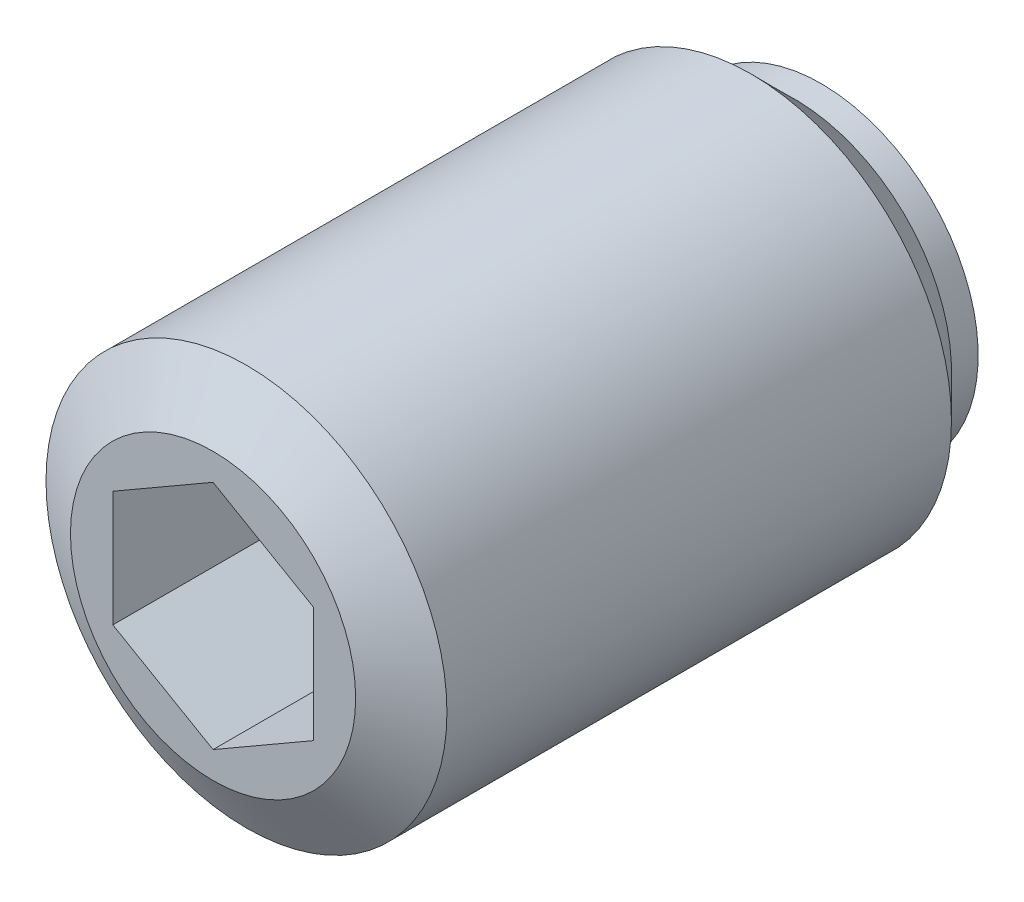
ISO-10303-21;
HEADER;
FILE_DESCRIPTION(('STEP AP214'),'2;1');
FILE_NAME('part.step','',(''),(''),'','','');
FILE_SCHEMA(('AUTOMOTIVE_DESIGN { 1 0 10303 214 1 1 1 1 }'));
ENDSEC;
DATA;
#1=APPLICATION_CONTEXT('core data for automotive mechanical design processes');
#2=APPLICATION_PROTOCOL_DEFINITION('international standard','automotive_design',2000,#1);
#3=PRODUCT_CONTEXT('',#1,'mechanical');
#4=PRODUCT('Part','Part','',(#3));
#5=PRODUCT_RELATED_PRODUCT_CATEGORY('part','',(#4));
#6=PRODUCT_DEFINITION_FORMATION('','',#4);
#7=PRODUCT_DEFINITION_CONTEXT('part definition',#1,'design');
#8=PRODUCT_DEFINITION('design','',#6,#7);
#9=PRODUCT_DEFINITION_SHAPE('','',#8);
#10=(LENGTH_UNIT() NAMED_UNIT(*) SI_UNIT(.MILLI.,.METRE.));
#11=(NAMED_UNIT(*) PLANE_ANGLE_UNIT() SI_UNIT($,.RADIAN.));
#12=(NAMED_UNIT(*) SI_UNIT($,.STERADIAN.) SOLID_ANGLE_UNIT());
#13=UNCERTAINTY_MEASURE_WITH_UNIT(LENGTH_MEASURE(1.E-05),#10,'distance_accuracy_value','');
#14=(GEOMETRIC_REPRESENTATION_CONTEXT(3) GLOBAL_UNCERTAINTY_ASSIGNED_CONTEXT((#13)) GLOBAL_UNIT_ASSIGNED_CONTEXT((#10,
#11,#12)) REPRESENTATION_CONTEXT('',''));
#15=CARTESIAN_POINT('',(0.,0.,0.));
#16=DIRECTION('',(0.,0.,1.));
#17=DIRECTION('',(1.,0.,0.));
#18=AXIS2_PLACEMENT_3D('',#15,#16,#17);
#19=CARTESIAN_POINT('',(0.,0.,2.));
#20=DIRECTION('',(0.,0.,1.));
#21=DIRECTION('',(0.,-1.,0.));
#22=AXIS2_PLACEMENT_3D('',#19,#20,#21);
#23=SPHERICAL_SURFACE('',#22,2.);
#24=CARTESIAN_POINT('',(0.,0.,0.9));
#25=DIRECTION('',(0.,0.,1.));
#26=DIRECTION('',(-1.,0.,0.));
#27=AXIS2_PLACEMENT_3D('',#24,#25,#26);
#28=CIRCLE('',#27,1.67032930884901);
#29=CARTESIAN_POINT('',(-1.67032930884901,0.,0.9));
#30=VERTEX_POINT('',#29);
#31=EDGE_CURVE('E9',#30,#30,#28,.T.);
#32=ORIENTED_EDGE('',*,*,#31,.F.);
#33=EDGE_LOOP('',(#32));
#34=FACE_BOUND('',#33,.T.);
#35=ADVANCED_FACE('F14',(#34),#23,.T.);
#36=CARTESIAN_POINT('',(0.,2.35,0.9));
#37=DIRECTION('',(0.,0.,1.));
#38=DIRECTION('',(-1.,0.,0.));
#39=AXIS2_PLACEMENT_3D('',#36,#37,#38);
#40=PLANE('',#39);
#41=CARTESIAN_POINT('',(0.,0.,0.9));
#42=DIRECTION('',(0.,0.,1.));
#43=DIRECTION('',(-1.,0.,0.));
#44=AXIS2_PLACEMENT_3D('',#41,#42,#43);
#45=CIRCLE('',#44,2.35);
#46=CARTESIAN_POINT('',(-2.35,0.,0.9));
#47=VERTEX_POINT('',#46);
#48=EDGE_CURVE('E21',#47,#47,#45,.T.);
#49=ORIENTED_EDGE('',*,*,#48,.F.);
#50=EDGE_LOOP('',(#49));
#51=FACE_BOUND('',#50,.T.);
#52=ORIENTED_EDGE('',*,*,#31,.T.);
#53=EDGE_LOOP('',(#52));
#54=FACE_BOUND('',#53,.T.);
#55=ADVANCED_FACE('F138',(#51,#54),#40,.F.);
#56=CARTESIAN_POINT('',(0.,0.,11.3950749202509));
#57=DIRECTION('',(0.,0.,1.));
#58=DIRECTION('',(-1.,0.,0.));
#59=AXIS2_PLACEMENT_3D('',#56,#57,#58);
#60=CYLINDRICAL_SURFACE('',#59,2.35);
#61=CARTESIAN_POINT('',(0.,0.,1.3));
#62=DIRECTION('',(0.,0.,1.));
#63=DIRECTION('',(-1.,0.,0.));
#64=AXIS2_PLACEMENT_3D('',#61,#62,#63);
#65=CIRCLE('',#64,2.35);
#66=CARTESIAN_POINT('',(-2.35,0.,1.3));
#67=VERTEX_POINT('',#66);
#68=EDGE_CURVE('E131',#67,#67,#65,.T.);
#69=ORIENTED_EDGE('',*,*,#68,.F.);
#70=EDGE_LOOP('',(#69));
#71=FACE_BOUND('',#70,.T.);
#72=ORIENTED_EDGE('',*,*,#48,.T.);
#73=EDGE_LOOP('',(#72));
#74=FACE_BOUND('',#73,.T.);
#75=ADVANCED_FACE('F136',(#71,#74),#60,.T.);
#76=CARTESIAN_POINT('',(0.,0.,1.3));
#77=DIRECTION('',(0.,0.,1.));
#78=DIRECTION('',(-1.,0.,0.));
#79=AXIS2_PLACEMENT_3D('',#76,#77,#78);
#80=CONICAL_SURFACE('',#79,2.35,0.78539816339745);
#81=CARTESIAN_POINT('',(0.,0.,1.95));
#82=DIRECTION('',(0.,0.,1.));
#83=DIRECTION('',(-1.,0.,0.));
#84=AXIS2_PLACEMENT_3D('',#81,#82,#83);
#85=CIRCLE('',#84,3.);
#86=CARTESIAN_POINT('',(-3.,0.,1.95));
#87=VERTEX_POINT('',#86);
#88=EDGE_CURVE('E128',#87,#87,#85,.T.);
#89=ORIENTED_EDGE('',*,*,#88,.F.);
#90=EDGE_LOOP('',(#89));
#91=FACE_BOUND('',#90,.T.);
#92=ORIENTED_EDGE('',*,*,#68,.T.);
#93=EDGE_LOOP('',(#92));
#94=FACE_BOUND('',#93,.T.);
#95=ADVANCED_FACE('F161',(#91,#94),#80,.T.);
#96=CARTESIAN_POINT('',(0.,0.,11.3950749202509));
#97=DIRECTION('',(0.,0.,1.));
#98=DIRECTION('',(-1.,0.,0.));
#99=AXIS2_PLACEMENT_3D('',#96,#97,#98);
#100=CYLINDRICAL_SURFACE('',#99,3.);
#101=CARTESIAN_POINT('',(0.,0.,9.5));
#102=DIRECTION('',(0.,0.,1.));
#103=DIRECTION('',(-1.,0.,0.));
#104=AXIS2_PLACEMENT_3D('',#101,#102,#103);
#105=CIRCLE('',#104,3.);
#106=CARTESIAN_POINT('',(-3.,0.,9.5));
#107=VERTEX_POINT('',#106);
#108=EDGE_CURVE('E125',#107,#107,#105,.T.);
#109=ORIENTED_EDGE('',*,*,#108,.F.);
#110=EDGE_LOOP('',(#109));
#111=FACE_BOUND('',#110,.T.);
#112=ORIENTED_EDGE('',*,*,#88,.T.);
#113=EDGE_LOOP('',(#112));
#114=FACE_BOUND('',#113,.T.);
#115=ADVANCED_FACE('F170',(#111,#114),#100,.T.);
#116=CARTESIAN_POINT('',(0.,0.,9.5));
#117=DIRECTION('',(0.,0.,-1.));
#118=DIRECTION('',(1.,0.,0.));
#119=AXIS2_PLACEMENT_3D('',#116,#117,#118);
#120=CONICAL_SURFACE('',#119,3.,1.04719755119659);
#121=CARTESIAN_POINT('',(0.,0.,10.));
#122=DIRECTION('',(0.,0.,1.));
#123=DIRECTION('',(-1.,0.,0.));
#124=AXIS2_PLACEMENT_3D('',#121,#122,#123);
#125=CIRCLE('',#124,2.13397459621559);
#126=CARTESIAN_POINT('',(-2.13397459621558,0.,10.));
#127=VERTEX_POINT('',#126);
#128=EDGE_CURVE('E116',#127,#127,#125,.T.);
#129=ORIENTED_EDGE('',*,*,#128,.F.);
#130=EDGE_LOOP('',(#129));
#131=FACE_BOUND('',#130,.T.);
#132=ORIENTED_EDGE('',*,*,#108,.T.);
#133=EDGE_LOOP('',(#132));
#134=FACE_BOUND('',#133,.T.);
#135=ADVANCED_FACE('F179',(#131,#134),#120,.T.);
#136=CARTESIAN_POINT('',(0.,0.,10.));
#137=DIRECTION('',(0.,0.,-1.));
#138=DIRECTION('',(1.,0.,0.));
#139=AXIS2_PLACEMENT_3D('',#136,#137,#138);
#140=PLANE('',#139);
#141=DIRECTION('',(-0.866025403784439,-0.5,0.));
#142=VECTOR('',#141,1.);
#143=CARTESIAN_POINT('',(0.,1.73205080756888,10.));
#144=LINE('',#143,#142);
#145=CARTESIAN_POINT('',(0.,1.73205080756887,10.));
#146=VERTEX_POINT('',#145);
#147=CARTESIAN_POINT('',(-1.5,0.866025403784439,10.));
#148=VERTEX_POINT('',#147);
#149=EDGE_CURVE('E82',#146,#148,#144,.T.);
#150=ORIENTED_EDGE('',*,*,#149,.F.);
#151=DIRECTION('',(-0.866025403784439,0.5,0.));
#152=VECTOR('',#151,1.);
#153=CARTESIAN_POINT('',(1.5,0.866025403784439,10.));
#154=LINE('',#153,#152);
#155=CARTESIAN_POINT('',(1.5,0.866025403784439,10.));
#156=VERTEX_POINT('',#155);
#157=EDGE_CURVE('E28',#156,#146,#154,.T.);
#158=ORIENTED_EDGE('',*,*,#157,.F.);
#159=DIRECTION('',(0.,1.,0.));
#160=VECTOR('',#159,1.);
#161=CARTESIAN_POINT('',(1.5,-0.866025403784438,10.));
#162=LINE('',#161,#160);
#163=CARTESIAN_POINT('',(1.5,-0.866025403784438,10.));
#164=VERTEX_POINT('',#163);
#165=EDGE_CURVE('E98',#164,#156,#162,.T.);
#166=ORIENTED_EDGE('',*,*,#165,.F.);
#167=DIRECTION('',(0.866025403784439,0.5,0.));
#168=VECTOR('',#167,1.);
#169=CARTESIAN_POINT('',(0.,-1.73205080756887,10.));
#170=LINE('',#169,#168);
#171=CARTESIAN_POINT('',(0.,-1.73205080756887,10.));
#172=VERTEX_POINT('',#171);
#173=EDGE_CURVE('E92',#172,#164,#170,.T.);
#174=ORIENTED_EDGE('',*,*,#173,.F.);
#175=DIRECTION('',(0.866025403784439,-0.5,0.));
#176=VECTOR('',#175,1.);
#177=CARTESIAN_POINT('',(-1.5,-0.86602540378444,10.));
#178=LINE('',#177,#176);
#179=CARTESIAN_POINT('',(-1.5,-0.86602540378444,10.));
#180=VERTEX_POINT('',#179);
#181=EDGE_CURVE('E90',#180,#172,#178,.T.);
#182=ORIENTED_EDGE('',*,*,#181,.F.);
#183=DIRECTION('',(0.,-1.,0.));
#184=VECTOR('',#183,1.);
#185=CARTESIAN_POINT('',(-1.5,0.866025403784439,10.));
#186=LINE('',#185,#184);
#187=EDGE_CURVE('E71',#148,#180,#186,.T.);
#188=ORIENTED_EDGE('',*,*,#187,.F.);
#189=EDGE_LOOP('',(#150,#158,#166,#174,#182,#188));
#190=FACE_BOUND('',#189,.T.);
#191=ORIENTED_EDGE('',*,*,#128,.T.);
#192=EDGE_LOOP('',(#191));
#193=FACE_BOUND('',#192,.T.);
#194=ADVANCED_FACE('F86',(#190,#193),#140,.F.);
#195=CARTESIAN_POINT('',(1.5,0.866025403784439,7.));
#196=DIRECTION('',(0.5,0.866025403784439,0.));
#197=DIRECTION('',(0.866025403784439,-0.5,0.));
#198=AXIS2_PLACEMENT_3D('',#195,#196,#197);
#199=PLANE('',#198);
#200=ORIENTED_EDGE('',*,*,#157,.T.);
#201=DIRECTION('',(0.,0.,1.));
#202=VECTOR('',#201,1.);
#203=CARTESIAN_POINT('',(0.,1.73205080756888,7.));
#204=LINE('',#203,#202);
#205=CARTESIAN_POINT('',(0.,1.73205080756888,7.));
#206=VERTEX_POINT('',#205);
#207=EDGE_CURVE('E79',#206,#146,#204,.T.);
#208=ORIENTED_EDGE('',*,*,#207,.F.);
#209=DIRECTION('',(-0.866025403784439,0.5,0.));
#210=VECTOR('',#209,1.);
#211=CARTESIAN_POINT('',(1.5,0.866025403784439,7.));
#212=LINE('',#211,#210);
#213=CARTESIAN_POINT('',(1.5,0.866025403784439,7.));
#214=VERTEX_POINT('',#213);
#215=EDGE_CURVE('E100',#214,#206,#212,.T.);
#216=ORIENTED_EDGE('',*,*,#215,.F.);
#217=DIRECTION('',(0.,0.,1.));
#218=VECTOR('',#217,1.);
#219=CARTESIAN_POINT('',(1.5,0.866025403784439,7.));
#220=LINE('',#219,#218);
#221=EDGE_CURVE('E35',#214,#156,#220,.T.);
#222=ORIENTED_EDGE('',*,*,#221,.T.);
#223=EDGE_LOOP('',(#200,#208,#216,#222));
#224=FACE_BOUND('',#223,.T.);
#225=ADVANCED_FACE('F196',(#224),#199,.F.);
#226=CARTESIAN_POINT('',(1.5,-0.866025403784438,7.));
#227=DIRECTION('',(1.,0.,0.));
#228=DIRECTION('',(0.,-1.,0.));
#229=AXIS2_PLACEMENT_3D('',#226,#227,#228);
#230=PLANE('',#229);
#231=ORIENTED_EDGE('',*,*,#165,.T.);
#232=ORIENTED_EDGE('',*,*,#221,.F.);
#233=DIRECTION('',(0.,1.,0.));
#234=VECTOR('',#233,1.);
#235=CARTESIAN_POINT('',(1.5,-0.866025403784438,7.));
#236=LINE('',#235,#234);
#237=CARTESIAN_POINT('',(1.5,-0.866025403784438,7.));
#238=VERTEX_POINT('',#237);
#239=EDGE_CURVE('E112',#238,#214,#236,.T.);
#240=ORIENTED_EDGE('',*,*,#239,.F.);
#241=DIRECTION('',(0.,0.,1.));
#242=VECTOR('',#241,1.);
#243=CARTESIAN_POINT('',(1.5,-0.866025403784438,7.));
#244=LINE('',#243,#242);
#245=EDGE_CURVE('E117',#238,#164,#244,.T.);
#246=ORIENTED_EDGE('',*,*,#245,.T.);
#247=EDGE_LOOP('',(#231,#232,#240,#246));
#248=FACE_BOUND('',#247,.T.);
#249=ADVANCED_FACE('F204',(#248),#230,.F.);
#250=CARTESIAN_POINT('',(0.,-1.73205080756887,7.));
#251=DIRECTION('',(0.5,-0.866025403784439,0.));
#252=DIRECTION('',(-0.866025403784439,-0.5,0.));
#253=AXIS2_PLACEMENT_3D('',#250,#251,#252);
#254=PLANE('',#253);
#255=ORIENTED_EDGE('',*,*,#173,.T.);
#256=ORIENTED_EDGE('',*,*,#245,.F.);
#257=DIRECTION('',(0.866025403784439,0.5,0.));
#258=VECTOR('',#257,1.);
#259=CARTESIAN_POINT('',(0.,-1.73205080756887,7.));
#260=LINE('',#259,#258);
#261=CARTESIAN_POINT('',(0.,-1.73205080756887,7.));
#262=VERTEX_POINT('',#261);
#263=EDGE_CURVE('E109',#262,#238,#260,.T.);
#264=ORIENTED_EDGE('',*,*,#263,.F.);
#265=DIRECTION('',(0.,0.,1.));
#266=VECTOR('',#265,1.);
#267=CARTESIAN_POINT('',(0.,-1.73205080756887,7.));
#268=LINE('',#267,#266);
#269=EDGE_CURVE('E119',#262,#172,#268,.T.);
#270=ORIENTED_EDGE('',*,*,#269,.T.);
#271=EDGE_LOOP('',(#255,#256,#264,#270));
#272=FACE_BOUND('',#271,.T.);
#273=ADVANCED_FACE('F212',(#272),#254,.F.);
#274=CARTESIAN_POINT('',(-1.5,-0.86602540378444,7.));
#275=DIRECTION('',(-0.5,-0.866025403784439,0.));
#276=DIRECTION('',(-0.866025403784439,0.5,0.));
#277=AXIS2_PLACEMENT_3D('',#274,#275,#276);
#278=PLANE('',#277);
#279=ORIENTED_EDGE('',*,*,#181,.T.);
#280=ORIENTED_EDGE('',*,*,#269,.F.);
#281=DIRECTION('',(0.866025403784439,-0.5,0.));
#282=VECTOR('',#281,1.);
#283=CARTESIAN_POINT('',(-1.5,-0.86602540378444,7.));
#284=LINE('',#283,#282);
#285=CARTESIAN_POINT('',(-1.5,-0.86602540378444,7.));
#286=VERTEX_POINT('',#285);
#287=EDGE_CURVE('E106',#286,#262,#284,.T.);
#288=ORIENTED_EDGE('',*,*,#287,.F.);
#289=DIRECTION('',(0.,0.,1.));
#290=VECTOR('',#289,1.);
#291=CARTESIAN_POINT('',(-1.5,-0.86602540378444,7.));
#292=LINE('',#291,#290);
#293=EDGE_CURVE('E78',#286,#180,#292,.T.);
#294=ORIENTED_EDGE('',*,*,#293,.T.);
#295=EDGE_LOOP('',(#279,#280,#288,#294));
#296=FACE_BOUND('',#295,.T.);
#297=ADVANCED_FACE('F220',(#296),#278,.F.);
#298=CARTESIAN_POINT('',(-1.5,0.866025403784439,7.));
#299=DIRECTION('',(-1.,0.,0.));
#300=DIRECTION('',(0.,1.,0.));
#301=AXIS2_PLACEMENT_3D('',#298,#299,#300);
#302=PLANE('',#301);
#303=ORIENTED_EDGE('',*,*,#187,.T.);
#304=ORIENTED_EDGE('',*,*,#293,.F.);
#305=DIRECTION('',(0.,-1.,0.));
#306=VECTOR('',#305,1.);
#307=CARTESIAN_POINT('',(-1.5,0.866025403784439,7.));
#308=LINE('',#307,#306);
#309=CARTESIAN_POINT('',(-1.5,0.866025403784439,7.));
#310=VERTEX_POINT('',#309);
#311=EDGE_CURVE('E74',#310,#286,#308,.T.);
#312=ORIENTED_EDGE('',*,*,#311,.F.);
#313=DIRECTION('',(0.,0.,1.));
#314=VECTOR('',#313,1.);
#315=CARTESIAN_POINT('',(-1.5,0.866025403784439,7.));
#316=LINE('',#315,#314);
#317=EDGE_CURVE('E67',#310,#148,#316,.T.);
#318=ORIENTED_EDGE('',*,*,#317,.T.);
#319=EDGE_LOOP('',(#303,#304,#312,#318));
#320=FACE_BOUND('',#319,.T.);
#321=ADVANCED_FACE('F69',(#320),#302,.F.);
#322=CARTESIAN_POINT('',(0.,1.73205080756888,7.));
#323=DIRECTION('',(-0.5,0.866025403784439,0.));
#324=DIRECTION('',(0.866025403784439,0.5,0.));
#325=AXIS2_PLACEMENT_3D('',#322,#323,#324);
#326=PLANE('',#325);
#327=ORIENTED_EDGE('',*,*,#149,.T.);
#328=ORIENTED_EDGE('',*,*,#317,.F.);
#329=DIRECTION('',(-0.866025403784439,-0.5,0.));
#330=VECTOR('',#329,1.);
#331=CARTESIAN_POINT('',(0.,1.73205080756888,7.));
#332=LINE('',#331,#330);
#333=EDGE_CURVE('E103',#206,#310,#332,.T.);
#334=ORIENTED_EDGE('',*,*,#333,.F.);
#335=ORIENTED_EDGE('',*,*,#207,.T.);
#336=EDGE_LOOP('',(#327,#328,#334,#335));
#337=FACE_BOUND('',#336,.T.);
#338=ADVANCED_FACE('F83',(#337),#326,.F.);
#339=CARTESIAN_POINT('',(3.,0.,7.));
#340=DIRECTION('',(0.,0.,-1.));
#341=DIRECTION('',(1.,0.,0.));
#342=AXIS2_PLACEMENT_3D('',#339,#340,#341);
#343=PLANE('',#342);
#344=ORIENTED_EDGE('',*,*,#215,.T.);
#345=ORIENTED_EDGE('',*,*,#333,.T.);
#346=ORIENTED_EDGE('',*,*,#311,.T.);
#347=ORIENTED_EDGE('',*,*,#287,.T.);
#348=ORIENTED_EDGE('',*,*,#263,.T.);
#349=ORIENTED_EDGE('',*,*,#239,.T.);
#350=EDGE_LOOP('',(#344,#345,#346,#347,#348,#349));
#351=FACE_BOUND('',#350,.T.);
#352=ADVANCED_FACE('F244',(#351),#343,.F.);
#353=CLOSED_SHELL('',(#35,#55,#75,#95,#115,#135,#194,#225,#249,#273,#297,#321,#338,#352));
#354=MANIFOLD_SOLID_BREP('B1',#353);
#355=ADVANCED_BREP_SHAPE_REPRESENTATION('',(#18,#354),#14);
#356=SHAPE_DEFINITION_REPRESENTATION(#9,#355);
ENDSEC;
END-ISO-10303-21;
